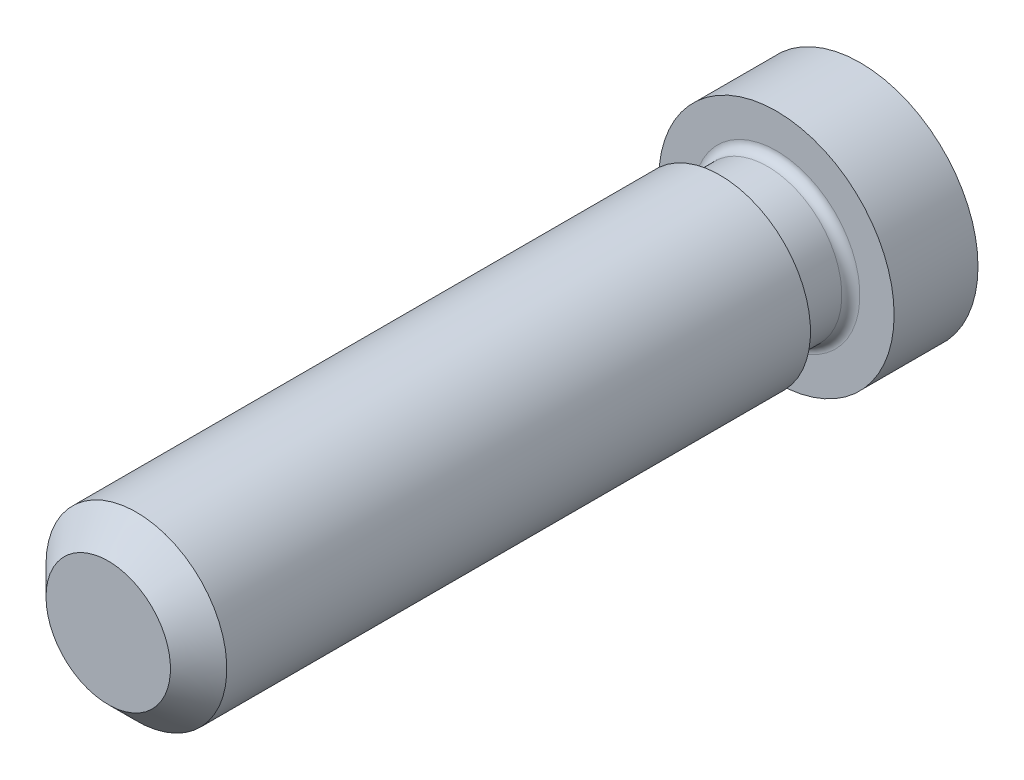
from build123d import *


with BuildPart() as part:
    # Sketch 1 → Revolve 1 (revolve)
    with BuildSketch(Plane(origin=(0, 0, 0), x_dir=(0, 0, -1), z_dir=(1, 0, 0)), mode=Mode.PRIVATE) as revolve_1_sk:
        with BuildLine():
            Line((0, 0), (0, 3.3147))
            Line((0, 3.3147), (-2.3622, 3.3147))
            Line((-2.3622, 3.3147), (-2.3622, 2.3495))
            ThreePointArc((-2.3622, 2.3495), (-2.436594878, 2.169894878), (-2.6162, 2.0955))
            Line((-2.6162, 2.0955), (-3.9497, 2.0955))
            Line((-3.9497, 2.0955), (-3.9497, 2.54635))
            Line((-3.9497, 2.54635), (-20.38985, 2.54635))
            Line((-20.38985, 2.54635), (-21.1836, 1.7526))
            Line((-21.1836, 1.7526), (-21.1836, 0))
            Line((-21.1836, 0), (0, 0))
        make_face()
    revolve(revolve_1_sk.sketch.rotate(Axis((0, 0, 0), (0, 0, 1)), 90), axis=Axis((0, 0, 0), (0, 0, 1)))


solid = part.part
